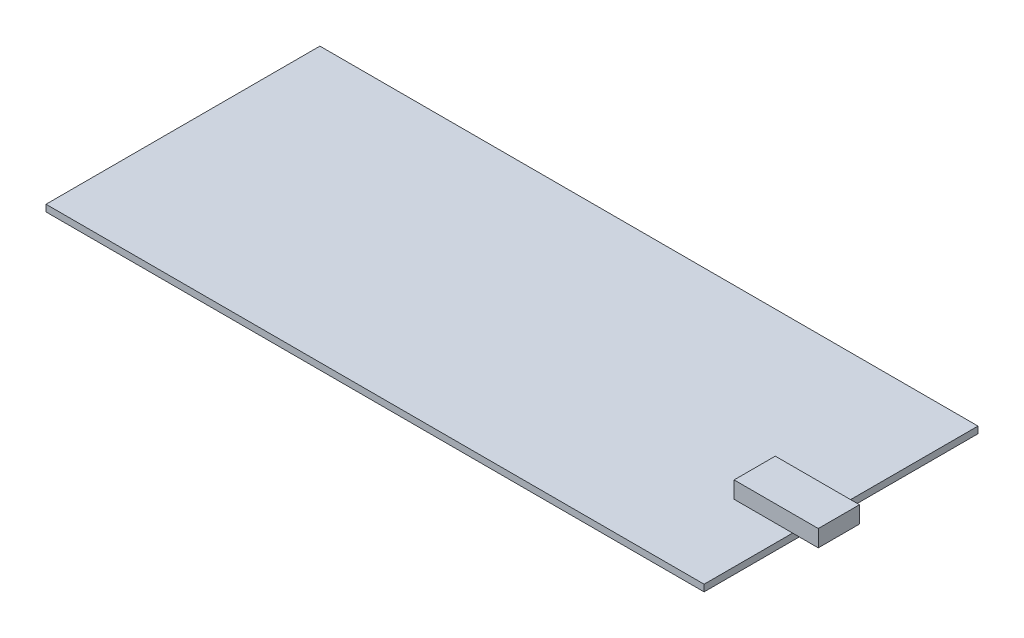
from build123d import *

# Parameters (mm, degrees)
SKETCH1_W           = 197
SKETCH1_H           = 81.99
BOSS_EXTRUDE1_DEPTH = 2
SKETCH2_W           = 25.19628618
SKETCH2_H           = 12.325
BOSS_EXTRUDE2_DEPTH = 5.025


with BuildPart() as part:
    # Sketch1 → Boss-Extrude1 (new body)
    with BuildSketch(Plane(origin=(0, 0, 0), x_dir=(1, 0, 0), z_dir=(0, 1, 0))):
        with Locations((98.5, 40.995)):
            Rectangle(SKETCH1_W, SKETCH1_H)
    extrude(amount=BOSS_EXTRUDE1_DEPTH)

    # Sketch2 → Boss-Extrude2 (add)
    with BuildSketch(Plane(origin=(0, 2, 0), x_dir=(1, 0, 0), z_dir=(0, 1, 0))):
        with Locations((192.079511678, 32.6625)):
            Rectangle(SKETCH2_W, SKETCH2_H)
    extrude(amount=BOSS_EXTRUDE2_DEPTH)


solid = part.part
